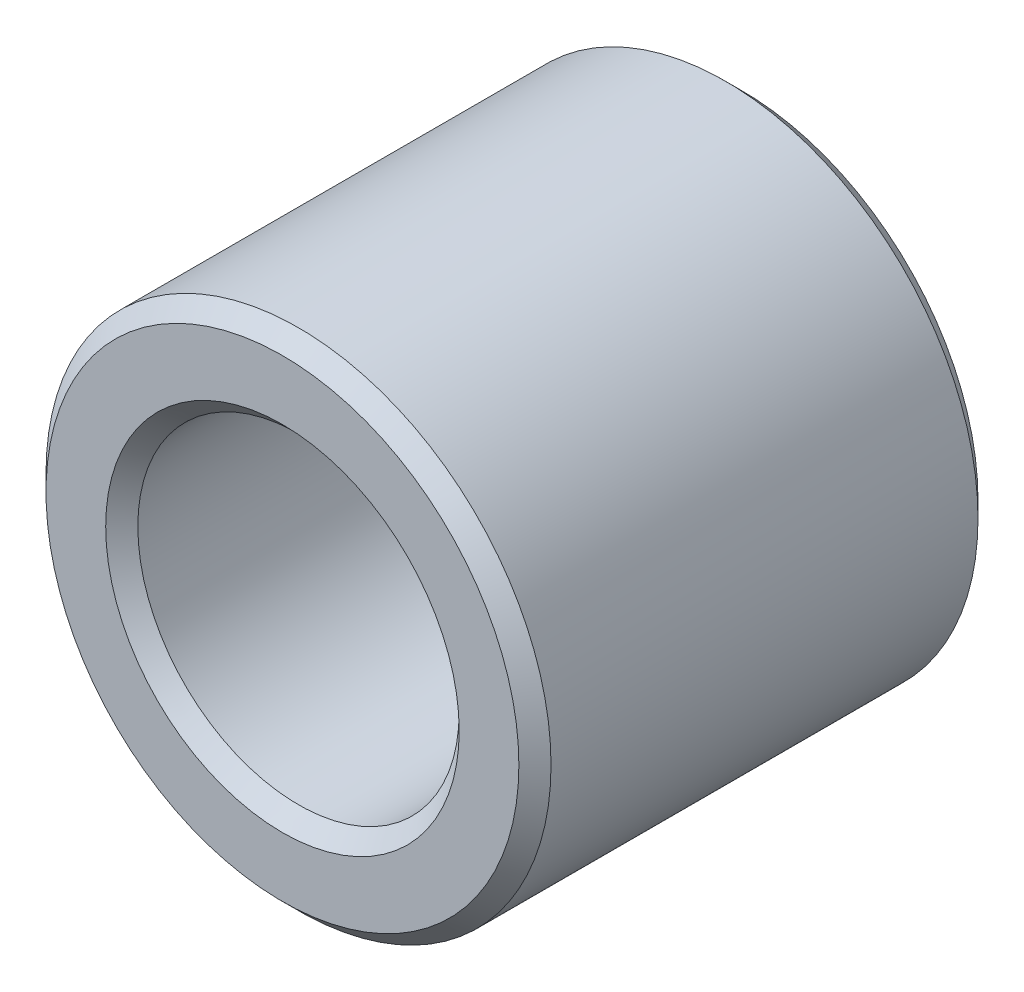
from build123d import *

# Parameters (mm, degrees)
SKETCH1_R           = 55
SKETCH1_R_2         = 35
BOSS_EXTRUDE1_DEPTH = 50
CHAMFER1_SIZE       = 3.5


with BuildPart() as part:
    # Sketch1 → Boss-Extrude1 (new, symmetric)
    with BuildSketch(Plane.XY):
        Circle(SKETCH1_R)
        Circle(SKETCH1_R_2, mode=Mode.SUBTRACT)
    extrude(amount=BOSS_EXTRUDE1_DEPTH, both=True)

    # Chamfer1
    chamfer1_edges = [part.edges().sort_by_distance(p)[0] for p in [
        (-55, 0, -50),
        (-55, 0, 50),
        (-35, 0, -50),
        (-35, 0, 50),
    ]]
    chamfer(chamfer1_edges, length=CHAMFER1_SIZE)


solid = part.part
